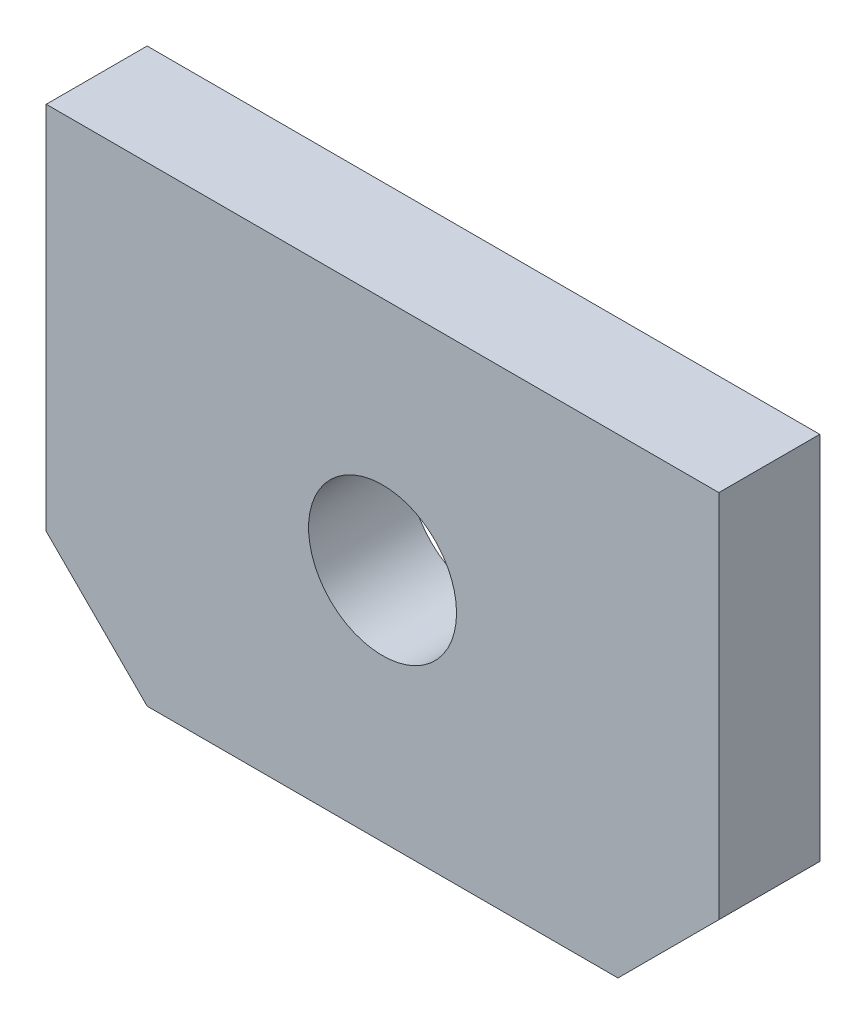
ISO-10303-21;
HEADER;
FILE_DESCRIPTION(('STEP AP214'),'2;1');
FILE_NAME('part.step','',(''),(''),'','','');
FILE_SCHEMA(('AUTOMOTIVE_DESIGN { 1 0 10303 214 1 1 1 1 }'));
ENDSEC;
DATA;
#1=APPLICATION_CONTEXT('core data for automotive mechanical design processes');
#2=APPLICATION_PROTOCOL_DEFINITION('international standard','automotive_design',2000,#1);
#3=PRODUCT_CONTEXT('',#1,'mechanical');
#4=PRODUCT('Part','Part','',(#3));
#5=PRODUCT_RELATED_PRODUCT_CATEGORY('part','',(#4));
#6=PRODUCT_DEFINITION_FORMATION('','',#4);
#7=PRODUCT_DEFINITION_CONTEXT('part definition',#1,'design');
#8=PRODUCT_DEFINITION('design','',#6,#7);
#9=PRODUCT_DEFINITION_SHAPE('','',#8);
#10=(LENGTH_UNIT() NAMED_UNIT(*) SI_UNIT(.MILLI.,.METRE.));
#11=(NAMED_UNIT(*) PLANE_ANGLE_UNIT() SI_UNIT($,.RADIAN.));
#12=(NAMED_UNIT(*) SI_UNIT($,.STERADIAN.) SOLID_ANGLE_UNIT());
#13=UNCERTAINTY_MEASURE_WITH_UNIT(LENGTH_MEASURE(1.E-05),#10,'distance_accuracy_value','');
#14=(GEOMETRIC_REPRESENTATION_CONTEXT(3) GLOBAL_UNCERTAINTY_ASSIGNED_CONTEXT((#13)) GLOBAL_UNIT_ASSIGNED_CONTEXT((#10,
#11,#12)) REPRESENTATION_CONTEXT('',''));
#15=CARTESIAN_POINT('',(0.,0.,0.));
#16=DIRECTION('',(0.,0.,1.));
#17=DIRECTION('',(1.,0.,0.));
#18=AXIS2_PLACEMENT_3D('',#15,#16,#17);
#19=CARTESIAN_POINT('',(-20.4509278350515,-9.50536082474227,1.5));
#20=DIRECTION('',(0.,0.,1.));
#21=DIRECTION('',(1.,0.,0.));
#22=AXIS2_PLACEMENT_3D('',#19,#20,#21);
#23=PLANE('',#22);
#24=DIRECTION('',(0.,-1.,0.));
#25=VECTOR('',#24,1.);
#26=CARTESIAN_POINT('',(-20.4509278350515,-2.50536082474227,1.5));
#27=LINE('',#26,#25);
#28=CARTESIAN_POINT('',(-20.4509278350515,-2.50536082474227,1.5));
#29=VERTEX_POINT('',#28);
#30=CARTESIAN_POINT('',(-20.4509278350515,-8.00536082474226,1.5));
#31=VERTEX_POINT('',#30);
#32=EDGE_CURVE('E112',#29,#31,#27,.T.);
#33=ORIENTED_EDGE('',*,*,#32,.T.);
#34=DIRECTION('',(0.707106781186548,-0.707106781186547,0.));
#35=VECTOR('',#34,1.);
#36=CARTESIAN_POINT('',(-20.4509278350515,-8.00536082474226,1.5));
#37=LINE('',#36,#35);
#38=CARTESIAN_POINT('',(-18.9509278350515,-9.50536082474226,1.5));
#39=VERTEX_POINT('',#38);
#40=EDGE_CURVE('E93',#31,#39,#37,.T.);
#41=ORIENTED_EDGE('',*,*,#40,.T.);
#42=DIRECTION('',(1.,0.,0.));
#43=VECTOR('',#42,1.);
#44=CARTESIAN_POINT('',(-18.9509278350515,-9.50536082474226,1.5));
#45=LINE('',#44,#43);
#46=CARTESIAN_POINT('',(-11.9509278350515,-9.50536082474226,1.5));
#47=VERTEX_POINT('',#46);
#48=EDGE_CURVE('E115',#39,#47,#45,.T.);
#49=ORIENTED_EDGE('',*,*,#48,.T.);
#50=DIRECTION('',(0.707106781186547,0.707106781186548,0.));
#51=VECTOR('',#50,1.);
#52=CARTESIAN_POINT('',(-10.4509278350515,-8.00536082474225,1.5));
#53=LINE('',#52,#51);
#54=CARTESIAN_POINT('',(-10.4509278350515,-8.00536082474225,1.5));
#55=VERTEX_POINT('',#54);
#56=EDGE_CURVE('E117',#47,#55,#53,.T.);
#57=ORIENTED_EDGE('',*,*,#56,.T.);
#58=DIRECTION('',(0.,1.,0.));
#59=VECTOR('',#58,1.);
#60=CARTESIAN_POINT('',(-10.4509278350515,-2.50536082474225,1.5));
#61=LINE('',#60,#59);
#62=CARTESIAN_POINT('',(-10.4509278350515,-2.50536082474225,1.5));
#63=VERTEX_POINT('',#62);
#64=EDGE_CURVE('E46',#55,#63,#61,.T.);
#65=ORIENTED_EDGE('',*,*,#64,.T.);
#66=DIRECTION('',(-1.,0.,0.));
#67=VECTOR('',#66,1.);
#68=CARTESIAN_POINT('',(-20.4509278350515,-2.50536082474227,1.5));
#69=LINE('',#68,#67);
#70=EDGE_CURVE('E41',#63,#29,#69,.T.);
#71=ORIENTED_EDGE('',*,*,#70,.T.);
#72=EDGE_LOOP('',(#33,#41,#49,#57,#65,#71));
#73=FACE_BOUND('',#72,.T.);
#74=CARTESIAN_POINT('',(-15.4509278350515,-6.00536082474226,1.5));
#75=DIRECTION('',(0.,0.,1.));
#76=DIRECTION('',(1.,0.,0.));
#77=AXIS2_PLACEMENT_3D('',#74,#75,#76);
#78=CIRCLE('',#77,1.1);
#79=CARTESIAN_POINT('',(-14.3509278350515,-6.00536082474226,1.5));
#80=VERTEX_POINT('',#79);
#81=EDGE_CURVE('E98',#80,#80,#78,.T.);
#82=ORIENTED_EDGE('',*,*,#81,.F.);
#83=EDGE_LOOP('',(#82));
#84=FACE_BOUND('',#83,.T.);
#85=ADVANCED_FACE('F26',(#73,#84),#23,.T.);
#86=CARTESIAN_POINT('',(-20.4509278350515,-9.50536082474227,0.));
#87=DIRECTION('',(0.,0.,1.));
#88=DIRECTION('',(1.,0.,0.));
#89=AXIS2_PLACEMENT_3D('',#86,#87,#88);
#90=PLANE('',#89);
#91=DIRECTION('',(0.,-1.,0.));
#92=VECTOR('',#91,1.);
#93=CARTESIAN_POINT('',(-20.4509278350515,-2.50536082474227,0.));
#94=LINE('',#93,#92);
#95=CARTESIAN_POINT('',(-20.4509278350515,-2.50536082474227,0.));
#96=VERTEX_POINT('',#95);
#97=CARTESIAN_POINT('',(-20.4509278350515,-8.00536082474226,0.));
#98=VERTEX_POINT('',#97);
#99=EDGE_CURVE('E84',#96,#98,#94,.T.);
#100=ORIENTED_EDGE('',*,*,#99,.F.);
#101=DIRECTION('',(-1.,0.,0.));
#102=VECTOR('',#101,1.);
#103=CARTESIAN_POINT('',(-20.4509278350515,-2.50536082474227,0.));
#104=LINE('',#103,#102);
#105=CARTESIAN_POINT('',(-10.4509278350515,-2.50536082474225,0.));
#106=VERTEX_POINT('',#105);
#107=EDGE_CURVE('E110',#106,#96,#104,.T.);
#108=ORIENTED_EDGE('',*,*,#107,.F.);
#109=DIRECTION('',(0.,1.,0.));
#110=VECTOR('',#109,1.);
#111=CARTESIAN_POINT('',(-10.4509278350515,-2.50536082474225,0.));
#112=LINE('',#111,#110);
#113=CARTESIAN_POINT('',(-10.4509278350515,-8.00536082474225,0.));
#114=VERTEX_POINT('',#113);
#115=EDGE_CURVE('E108',#114,#106,#112,.T.);
#116=ORIENTED_EDGE('',*,*,#115,.F.);
#117=DIRECTION('',(0.707106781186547,0.707106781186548,0.));
#118=VECTOR('',#117,1.);
#119=CARTESIAN_POINT('',(-10.4509278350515,-8.00536082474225,0.));
#120=LINE('',#119,#118);
#121=CARTESIAN_POINT('',(-11.9509278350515,-9.50536082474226,0.));
#122=VERTEX_POINT('',#121);
#123=EDGE_CURVE('E106',#122,#114,#120,.T.);
#124=ORIENTED_EDGE('',*,*,#123,.F.);
#125=DIRECTION('',(1.,0.,0.));
#126=VECTOR('',#125,1.);
#127=CARTESIAN_POINT('',(-18.9509278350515,-9.50536082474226,0.));
#128=LINE('',#127,#126);
#129=CARTESIAN_POINT('',(-18.9509278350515,-9.50536082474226,0.));
#130=VERTEX_POINT('',#129);
#131=EDGE_CURVE('E86',#130,#122,#128,.T.);
#132=ORIENTED_EDGE('',*,*,#131,.F.);
#133=DIRECTION('',(0.707106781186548,-0.707106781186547,0.));
#134=VECTOR('',#133,1.);
#135=CARTESIAN_POINT('',(-20.4509278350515,-8.00536082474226,0.));
#136=LINE('',#135,#134);
#137=EDGE_CURVE('E79',#98,#130,#136,.T.);
#138=ORIENTED_EDGE('',*,*,#137,.F.);
#139=EDGE_LOOP('',(#100,#108,#116,#124,#132,#138));
#140=FACE_BOUND('',#139,.T.);
#141=CARTESIAN_POINT('',(-15.4509278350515,-6.00536082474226,0.));
#142=DIRECTION('',(0.,0.,1.));
#143=DIRECTION('',(1.,0.,0.));
#144=AXIS2_PLACEMENT_3D('',#141,#142,#143);
#145=CIRCLE('',#144,1.1);
#146=CARTESIAN_POINT('',(-14.3509278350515,-6.00536082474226,0.));
#147=VERTEX_POINT('',#146);
#148=EDGE_CURVE('E101',#147,#147,#145,.T.);
#149=ORIENTED_EDGE('',*,*,#148,.T.);
#150=EDGE_LOOP('',(#149));
#151=FACE_BOUND('',#150,.T.);
#152=ADVANCED_FACE('F80',(#140,#151),#90,.F.);
#153=CARTESIAN_POINT('',(-20.4509278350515,-2.50536082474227,1.5));
#154=DIRECTION('',(1.,0.,0.));
#155=DIRECTION('',(0.,0.,-1.));
#156=AXIS2_PLACEMENT_3D('',#153,#154,#155);
#157=PLANE('',#156);
#158=ORIENTED_EDGE('',*,*,#99,.T.);
#159=DIRECTION('',(0.,0.,-1.));
#160=VECTOR('',#159,1.);
#161=CARTESIAN_POINT('',(-20.4509278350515,-8.00536082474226,1.5));
#162=LINE('',#161,#160);
#163=EDGE_CURVE('E11',#31,#98,#162,.T.);
#164=ORIENTED_EDGE('',*,*,#163,.F.);
#165=ORIENTED_EDGE('',*,*,#32,.F.);
#166=DIRECTION('',(0.,0.,-1.));
#167=VECTOR('',#166,1.);
#168=CARTESIAN_POINT('',(-20.4509278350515,-2.50536082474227,1.5));
#169=LINE('',#168,#167);
#170=EDGE_CURVE('E97',#29,#96,#169,.T.);
#171=ORIENTED_EDGE('',*,*,#170,.T.);
#172=EDGE_LOOP('',(#158,#164,#165,#171));
#173=FACE_BOUND('',#172,.T.);
#174=ADVANCED_FACE('F28',(#173),#157,.F.);
#175=CARTESIAN_POINT('',(-20.4509278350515,-8.00536082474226,1.5));
#176=DIRECTION('',(0.707106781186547,0.707106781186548,0.));
#177=DIRECTION('',(-0.707106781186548,0.707106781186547,0.));
#178=AXIS2_PLACEMENT_3D('',#175,#176,#177);
#179=PLANE('',#178);
#180=ORIENTED_EDGE('',*,*,#137,.T.);
#181=DIRECTION('',(0.,0.,-1.));
#182=VECTOR('',#181,1.);
#183=CARTESIAN_POINT('',(-18.9509278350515,-9.50536082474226,1.5));
#184=LINE('',#183,#182);
#185=EDGE_CURVE('E34',#39,#130,#184,.T.);
#186=ORIENTED_EDGE('',*,*,#185,.F.);
#187=ORIENTED_EDGE('',*,*,#40,.F.);
#188=ORIENTED_EDGE('',*,*,#163,.T.);
#189=EDGE_LOOP('',(#180,#186,#187,#188));
#190=FACE_BOUND('',#189,.T.);
#191=ADVANCED_FACE('F92',(#190),#179,.F.);
#192=CARTESIAN_POINT('',(-18.9509278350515,-9.50536082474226,1.5));
#193=DIRECTION('',(0.,1.,0.));
#194=DIRECTION('',(-1.,0.,0.));
#195=AXIS2_PLACEMENT_3D('',#192,#193,#194);
#196=PLANE('',#195);
#197=ORIENTED_EDGE('',*,*,#131,.T.);
#198=DIRECTION('',(0.,0.,-1.));
#199=VECTOR('',#198,1.);
#200=CARTESIAN_POINT('',(-11.9509278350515,-9.50536082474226,1.5));
#201=LINE('',#200,#199);
#202=EDGE_CURVE('E128',#47,#122,#201,.T.);
#203=ORIENTED_EDGE('',*,*,#202,.F.);
#204=ORIENTED_EDGE('',*,*,#48,.F.);
#205=ORIENTED_EDGE('',*,*,#185,.T.);
#206=EDGE_LOOP('',(#197,#203,#204,#205));
#207=FACE_BOUND('',#206,.T.);
#208=ADVANCED_FACE('F132',(#207),#196,.F.);
#209=CARTESIAN_POINT('',(-10.4509278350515,-8.00536082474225,1.5));
#210=DIRECTION('',(-0.707106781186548,0.707106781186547,0.));
#211=DIRECTION('',(-0.707106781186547,-0.707106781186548,0.));
#212=AXIS2_PLACEMENT_3D('',#209,#210,#211);
#213=PLANE('',#212);
#214=ORIENTED_EDGE('',*,*,#123,.T.);
#215=DIRECTION('',(0.,0.,-1.));
#216=VECTOR('',#215,1.);
#217=CARTESIAN_POINT('',(-10.4509278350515,-8.00536082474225,1.5));
#218=LINE('',#217,#216);
#219=EDGE_CURVE('E125',#55,#114,#218,.T.);
#220=ORIENTED_EDGE('',*,*,#219,.F.);
#221=ORIENTED_EDGE('',*,*,#56,.F.);
#222=ORIENTED_EDGE('',*,*,#202,.T.);
#223=EDGE_LOOP('',(#214,#220,#221,#222));
#224=FACE_BOUND('',#223,.T.);
#225=ADVANCED_FACE('F138',(#224),#213,.F.);
#226=CARTESIAN_POINT('',(-10.4509278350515,-2.50536082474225,1.5));
#227=DIRECTION('',(-1.,0.,0.));
#228=DIRECTION('',(0.,-1.,0.));
#229=AXIS2_PLACEMENT_3D('',#226,#227,#228);
#230=PLANE('',#229);
#231=ORIENTED_EDGE('',*,*,#115,.T.);
#232=DIRECTION('',(0.,0.,-1.));
#233=VECTOR('',#232,1.);
#234=CARTESIAN_POINT('',(-10.4509278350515,-2.50536082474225,1.5));
#235=LINE('',#234,#233);
#236=EDGE_CURVE('E122',#63,#106,#235,.T.);
#237=ORIENTED_EDGE('',*,*,#236,.F.);
#238=ORIENTED_EDGE('',*,*,#64,.F.);
#239=ORIENTED_EDGE('',*,*,#219,.T.);
#240=EDGE_LOOP('',(#231,#237,#238,#239));
#241=FACE_BOUND('',#240,.T.);
#242=ADVANCED_FACE('F141',(#241),#230,.F.);
#243=CARTESIAN_POINT('',(-20.4509278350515,-2.50536082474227,1.5));
#244=DIRECTION('',(0.,-1.,0.));
#245=DIRECTION('',(1.,0.,0.));
#246=AXIS2_PLACEMENT_3D('',#243,#244,#245);
#247=PLANE('',#246);
#248=ORIENTED_EDGE('',*,*,#107,.T.);
#249=ORIENTED_EDGE('',*,*,#170,.F.);
#250=ORIENTED_EDGE('',*,*,#70,.F.);
#251=ORIENTED_EDGE('',*,*,#236,.T.);
#252=EDGE_LOOP('',(#248,#249,#250,#251));
#253=FACE_BOUND('',#252,.T.);
#254=ADVANCED_FACE('F143',(#253),#247,.F.);
#255=CARTESIAN_POINT('',(-15.4509278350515,-6.00536082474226,1.5));
#256=DIRECTION('',(0.,0.,-1.));
#257=DIRECTION('',(-1.,0.,0.));
#258=AXIS2_PLACEMENT_3D('',#255,#256,#257);
#259=CYLINDRICAL_SURFACE('',#258,1.1);
#260=ORIENTED_EDGE('',*,*,#81,.T.);
#261=EDGE_LOOP('',(#260));
#262=FACE_BOUND('',#261,.T.);
#263=ORIENTED_EDGE('',*,*,#148,.F.);
#264=EDGE_LOOP('',(#263));
#265=FACE_BOUND('',#264,.T.);
#266=ADVANCED_FACE('F145',(#262,#265),#259,.F.);
#267=CLOSED_SHELL('',(#85,#152,#174,#191,#208,#225,#242,#254,#266));
#268=MANIFOLD_SOLID_BREP('B2',#267);
#269=ADVANCED_BREP_SHAPE_REPRESENTATION('',(#18,#268),#14);
#270=SHAPE_DEFINITION_REPRESENTATION(#9,#269);
ENDSEC;
END-ISO-10303-21;
